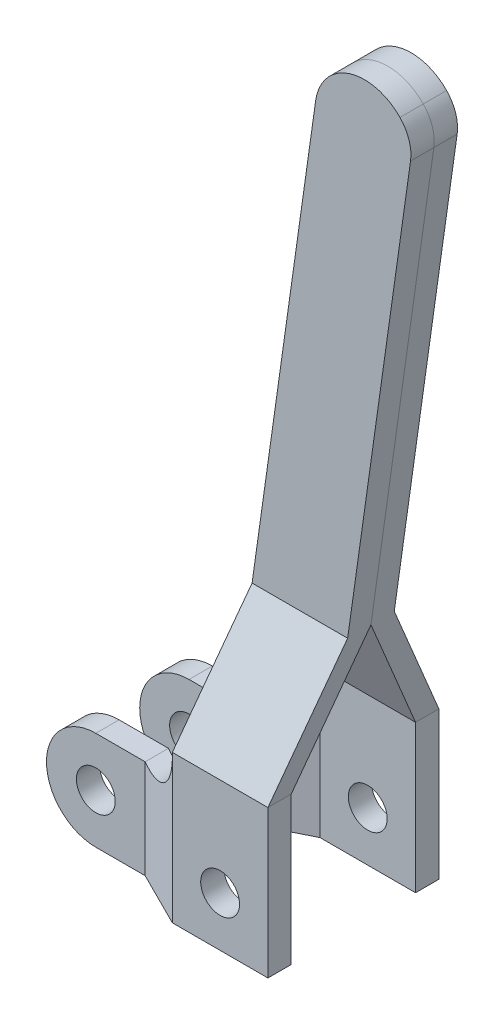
from build123d import *

# Parameters (mm, degrees)
SKETCH1_R           = 2.5
BOSS_EXTRUDE1_DEPTH = 3
SKETCH2_W           = 12.3
SKETCH2_H           = 19
SKETCH2_R           = 2.5
BOSS_EXTRUDE2_DEPTH = 3
BOSS_EXTRUDE3_DEPTH = 19
CUT_EXTRUDE1_DEPTH  = 28.852109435
BOSS_EXTRUDE4_DEPTH = 11
CUT_EXTRUDE5_DEPTH  = 104.093757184
FILLET7_R           = 5


with BuildPart() as part:
    # Sketch1 → Boss-Extrude1 (new body)
    with BuildSketch(Plane.XY):
        with BuildLine():
            Line((-6.35, 12.7), (0, 12.7))
            Line((0, 12.7), (0, 0))
            Line((0, 0), (-6.35, 0))
            ThreePointArc((-6.35, 0), (-12.7, 6.35), (-6.35, 12.7))
        make_face()
        with Locations((-6.35, 6.35)):
            Circle(SKETCH1_R, mode=Mode.SUBTRACT)
    extrude(amount=BOSS_EXTRUDE1_DEPTH)



with BuildPart() as body_2:
    # Sketch2 → Boss-Extrude2 (new body)
    with BuildSketch(Plane.XY.offset(6.5)):
        with Locations((13.15, 9.5)):
            Rectangle(SKETCH2_W, SKETCH2_H)
        with Locations((13.15, 6.4)):
            Circle(SKETCH2_R, mode=Mode.SUBTRACT)
    extrude(amount=-BOSS_EXTRUDE2_DEPTH)


with BuildPart() as part_1:
    add(part.part)

    add(body_2.part)  # Boss-Extrude3 merges body 2
    # Sketch3 → Boss-Extrude3 (add)
    with BuildSketch(Plane(origin=(0, 0, 0), x_dir=(1, 0, 0), z_dir=(0, 1, 0))):
        Polygon((0, -3), (0, 0), (7, -3.5), (7, -6.5), align=None)
    extrude(amount=BOSS_EXTRUDE3_DEPTH)

    # Sketch5 → Cut-Extrude1 (cut, through all)
    with BuildSketch(Plane.XY.offset(6.5)):
        with BuildLine():
            Line((0, 12.7), (-4.809205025, 20.811734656))
            Line((-4.809205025, 20.811734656), (7, 21.401334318))
            Line((7, 21.401334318), (7, 19))
            ThreePointArc((7, 19), (5.02621985, 14.154200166), (0, 12.7))
        make_face()
    extrude(amount=-CUT_EXTRUDE1_DEPTH, mode=Mode.SUBTRACT)

    # Sketch8 → Loft1 section 0
    with BuildSketch(Plane(origin=(0, 35, 0), x_dir=(1, 0, 0), z_dir=(0, 1, 0))):
        with BuildLine():
            Line((9.262431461, 4.5), (9.262431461, 1.5))
            Line((9.262431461, 1.5), (21.562431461, 1.5))
            Line((21.562431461, 1.5), (21.562431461, 4.5))
            Line((21.562431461, 4.5), (9.262431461, 4.5))
        make_face()
    # Sketch9 → Loft1 section 1
    with BuildSketch(Plane(origin=(0, 19, 0), x_dir=(1, 0, 0), z_dir=(0, 1, 0))):
        with BuildLine():
            Line((19.3, -6.5), (7, -6.5))
            Line((7, -6.5), (7, -3.5))
            Line((7, -3.5), (19.3, -3.5))
            Line((19.3, -3.5), (19.3, -6.5))
        make_face()
    loft()

    # Sketch10 → Boss-Extrude4 (add)
    with BuildSketch(Plane.XY.offset(6.5)):
        with BuildLine():
            Line((9.262431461, 35), (21.562431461, 35))
            Line((21.562431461, 35), (29.859676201, 93.678425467))
            ThreePointArc((29.859676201, 93.678425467), (23.332472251, 98.337196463), (17.448058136, 92.88905833))
            Line((17.448058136, 92.88905833), (9.262431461, 35))
        make_face()
    extrude(amount=-BOSS_EXTRUDE4_DEPTH)

    # Sketch13 → Cut-Extrude5 (cut, through all)
    with BuildSketch(Plane(origin=(0, 0, -1.5), x_dir=(-1, 0, 0), z_dir=(0, 0, -1))):
        with BuildLine():
            Line((-21.562431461, 35), (-9.262431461, 35))
            Line((-9.262431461, 35), (-17.448058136, 92.88905833))
            ThreePointArc((-17.448058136, 92.88905833), (-23.332472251, 98.337196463), (-29.859676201, 93.678425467))
            Line((-29.859676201, 93.678425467), (-21.562431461, 35))
        make_face()
    extrude(amount=-CUT_EXTRUDE5_DEPTH, mode=Mode.SUBTRACT)

    # Fillet7
    fillet7_edges = [part_1.edges().sort_by_distance(p)[0] for p in [
        (29.859676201, 93.678425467, -3),
    ]]
    fillet(fillet7_edges, radius=FILLET7_R)


with BuildPart() as body_2_2:
    # Mirror3: mirrored copy
    add(part_1.part.mirror(Plane(origin=(0, 0, -4.5), x_dir=(1, 0, 0), z_dir=(0, 0, -1))))


solid = Compound([part_1.part, body_2_2.part])
